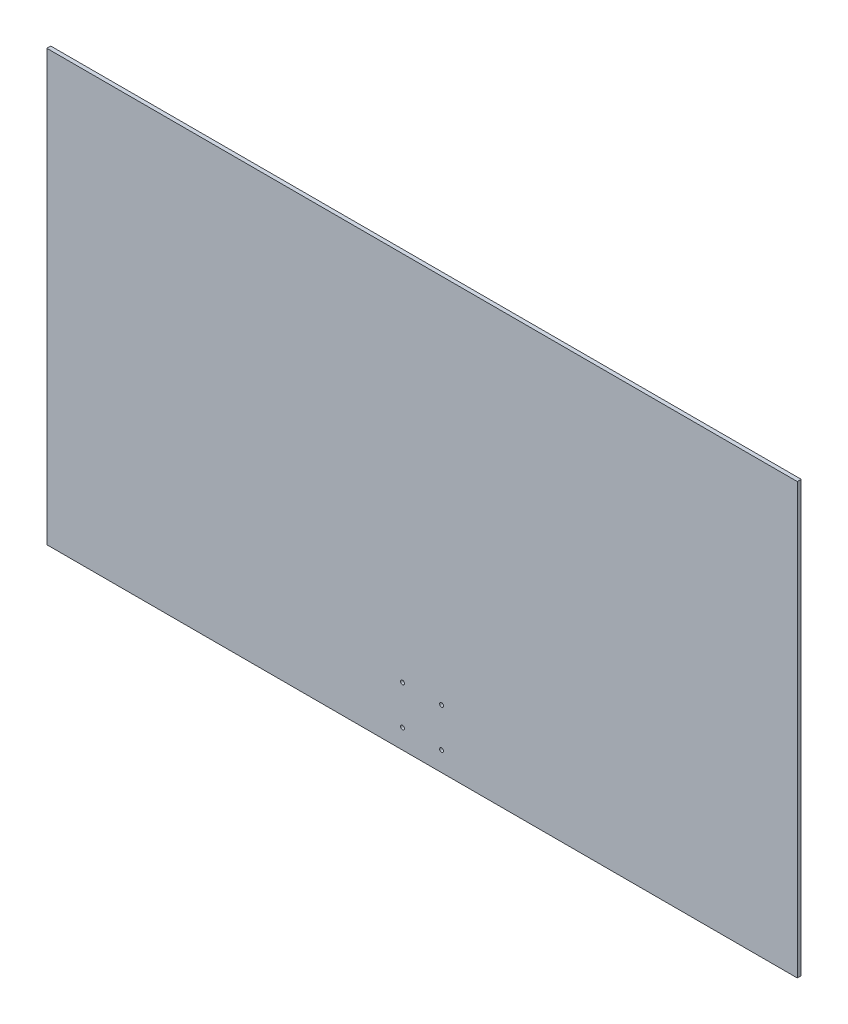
ISO-10303-21;
HEADER;
FILE_DESCRIPTION(('STEP AP214'),'2;1');
FILE_NAME('part.step','',(''),(''),'','','');
FILE_SCHEMA(('AUTOMOTIVE_DESIGN { 1 0 10303 214 1 1 1 1 }'));
ENDSEC;
DATA;
#1=APPLICATION_CONTEXT('core data for automotive mechanical design processes');
#2=APPLICATION_PROTOCOL_DEFINITION('international standard','automotive_design',2000,#1);
#3=PRODUCT_CONTEXT('',#1,'mechanical');
#4=PRODUCT('Part','Part','',(#3));
#5=PRODUCT_RELATED_PRODUCT_CATEGORY('part','',(#4));
#6=PRODUCT_DEFINITION_FORMATION('','',#4);
#7=PRODUCT_DEFINITION_CONTEXT('part definition',#1,'design');
#8=PRODUCT_DEFINITION('design','',#6,#7);
#9=PRODUCT_DEFINITION_SHAPE('','',#8);
#10=(LENGTH_UNIT() NAMED_UNIT(*) SI_UNIT(.MILLI.,.METRE.));
#11=(NAMED_UNIT(*) PLANE_ANGLE_UNIT() SI_UNIT($,.RADIAN.));
#12=(NAMED_UNIT(*) SI_UNIT($,.STERADIAN.) SOLID_ANGLE_UNIT());
#13=UNCERTAINTY_MEASURE_WITH_UNIT(LENGTH_MEASURE(1.E-05),#10,'distance_accuracy_value','');
#14=(GEOMETRIC_REPRESENTATION_CONTEXT(3) GLOBAL_UNCERTAINTY_ASSIGNED_CONTEXT((#13)) GLOBAL_UNIT_ASSIGNED_CONTEXT((#10,
#11,#12)) REPRESENTATION_CONTEXT('',''));
#15=CARTESIAN_POINT('',(0.,0.,0.));
#16=DIRECTION('',(0.,0.,1.));
#17=DIRECTION('',(1.,0.,0.));
#18=AXIS2_PLACEMENT_3D('',#15,#16,#17);
#19=CARTESIAN_POINT('',(0.,0.,5.));
#20=DIRECTION('',(0.,0.,-1.));
#21=DIRECTION('',(-1.,0.,0.));
#22=AXIS2_PLACEMENT_3D('',#19,#20,#21);
#23=PLANE('',#22);
#24=DIRECTION('',(0.,-1.,0.));
#25=VECTOR('',#24,1.);
#26=CARTESIAN_POINT('',(0.,0.,5.));
#27=LINE('',#26,#25);
#28=CARTESIAN_POINT('',(0.,550.,5.));
#29=VERTEX_POINT('',#28);
#30=CARTESIAN_POINT('',(0.,0.,5.));
#31=VERTEX_POINT('',#30);
#32=EDGE_CURVE('E85',#29,#31,#27,.T.);
#33=ORIENTED_EDGE('',*,*,#32,.T.);
#34=DIRECTION('',(1.,0.,0.));
#35=VECTOR('',#34,1.);
#36=CARTESIAN_POINT('',(0.,0.,5.));
#37=LINE('',#36,#35);
#38=CARTESIAN_POINT('',(960.,1.17566092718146E-13,5.));
#39=VERTEX_POINT('',#38);
#40=EDGE_CURVE('E80',#31,#39,#37,.T.);
#41=ORIENTED_EDGE('',*,*,#40,.T.);
#42=DIRECTION('',(0.,1.,0.));
#43=VECTOR('',#42,1.);
#44=CARTESIAN_POINT('',(960.,1.17566092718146E-13,5.));
#45=LINE('',#44,#43);
#46=CARTESIAN_POINT('',(960.,550.,5.));
#47=VERTEX_POINT('',#46);
#48=EDGE_CURVE('E83',#39,#47,#45,.T.);
#49=ORIENTED_EDGE('',*,*,#48,.T.);
#50=DIRECTION('',(-1.,0.,0.));
#51=VECTOR('',#50,1.);
#52=CARTESIAN_POINT('',(0.,550.,5.));
#53=LINE('',#52,#51);
#54=EDGE_CURVE('E50',#47,#29,#53,.T.);
#55=ORIENTED_EDGE('',*,*,#54,.T.);
#56=EDGE_LOOP('',(#33,#41,#49,#55));
#57=FACE_BOUND('',#56,.T.);
#58=CARTESIAN_POINT('',(455.,25.,5.));
#59=DIRECTION('',(0.,0.,1.));
#60=DIRECTION('',(1.,0.,0.));
#61=AXIS2_PLACEMENT_3D('',#58,#59,#60);
#62=CIRCLE('',#61,2.50000000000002);
#63=CARTESIAN_POINT('',(457.5,25.,5.));
#64=VERTEX_POINT('',#63);
#65=EDGE_CURVE('E100',#64,#64,#62,.T.);
#66=ORIENTED_EDGE('',*,*,#65,.F.);
#67=EDGE_LOOP('',(#66));
#68=FACE_BOUND('',#67,.T.);
#69=CARTESIAN_POINT('',(455.,75.,5.));
#70=DIRECTION('',(0.,0.,1.));
#71=DIRECTION('',(1.,0.,0.));
#72=AXIS2_PLACEMENT_3D('',#69,#70,#71);
#73=CIRCLE('',#72,2.50000000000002);
#74=CARTESIAN_POINT('',(457.5,75.,5.));
#75=VERTEX_POINT('',#74);
#76=EDGE_CURVE('E115',#75,#75,#73,.T.);
#77=ORIENTED_EDGE('',*,*,#76,.F.);
#78=EDGE_LOOP('',(#77));
#79=FACE_BOUND('',#78,.T.);
#80=CARTESIAN_POINT('',(505.,25.,5.));
#81=DIRECTION('',(0.,0.,1.));
#82=DIRECTION('',(-1.,0.,0.));
#83=AXIS2_PLACEMENT_3D('',#80,#81,#82);
#84=CIRCLE('',#83,2.50000000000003);
#85=CARTESIAN_POINT('',(502.5,25.,5.));
#86=VERTEX_POINT('',#85);
#87=EDGE_CURVE('E121',#86,#86,#84,.T.);
#88=ORIENTED_EDGE('',*,*,#87,.F.);
#89=EDGE_LOOP('',(#88));
#90=FACE_BOUND('',#89,.T.);
#91=CARTESIAN_POINT('',(505.,75.,5.));
#92=DIRECTION('',(0.,0.,1.));
#93=DIRECTION('',(-1.,0.,0.));
#94=AXIS2_PLACEMENT_3D('',#91,#92,#93);
#95=CIRCLE('',#94,2.50000000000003);
#96=CARTESIAN_POINT('',(502.5,75.,5.));
#97=VERTEX_POINT('',#96);
#98=EDGE_CURVE('E127',#97,#97,#95,.T.);
#99=ORIENTED_EDGE('',*,*,#98,.F.);
#100=EDGE_LOOP('',(#99));
#101=FACE_BOUND('',#100,.T.);
#102=ADVANCED_FACE('F33',(#57,#68,#79,#90,#101),#23,.F.);
#103=CARTESIAN_POINT('',(0.,0.,0.));
#104=DIRECTION('',(0.,0.,-1.));
#105=DIRECTION('',(-1.,0.,0.));
#106=AXIS2_PLACEMENT_3D('',#103,#104,#105);
#107=PLANE('',#106);
#108=CARTESIAN_POINT('',(505.,25.,0.));
#109=DIRECTION('',(0.,0.,1.));
#110=DIRECTION('',(-1.,0.,0.));
#111=AXIS2_PLACEMENT_3D('',#108,#109,#110);
#112=CIRCLE('',#111,2.50000000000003);
#113=CARTESIAN_POINT('',(502.5,25.,0.));
#114=VERTEX_POINT('',#113);
#115=EDGE_CURVE('E124',#114,#114,#112,.T.);
#116=ORIENTED_EDGE('',*,*,#115,.T.);
#117=EDGE_LOOP('',(#116));
#118=FACE_BOUND('',#117,.T.);
#119=CARTESIAN_POINT('',(455.,25.,0.));
#120=DIRECTION('',(0.,0.,1.));
#121=DIRECTION('',(1.,0.,0.));
#122=AXIS2_PLACEMENT_3D('',#119,#120,#121);
#123=CIRCLE('',#122,2.50000000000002);
#124=CARTESIAN_POINT('',(457.5,25.,0.));
#125=VERTEX_POINT('',#124);
#126=EDGE_CURVE('E112',#125,#125,#123,.T.);
#127=ORIENTED_EDGE('',*,*,#126,.T.);
#128=EDGE_LOOP('',(#127));
#129=FACE_BOUND('',#128,.T.);
#130=DIRECTION('',(0.,-1.,0.));
#131=VECTOR('',#130,1.);
#132=CARTESIAN_POINT('',(0.,0.,0.));
#133=LINE('',#132,#131);
#134=CARTESIAN_POINT('',(0.,550.,0.));
#135=VERTEX_POINT('',#134);
#136=CARTESIAN_POINT('',(0.,0.,0.));
#137=VERTEX_POINT('',#136);
#138=EDGE_CURVE('E97',#135,#137,#133,.T.);
#139=ORIENTED_EDGE('',*,*,#138,.F.);
#140=DIRECTION('',(-1.,0.,0.));
#141=VECTOR('',#140,1.);
#142=CARTESIAN_POINT('',(0.,550.,0.));
#143=LINE('',#142,#141);
#144=CARTESIAN_POINT('',(960.,550.,0.));
#145=VERTEX_POINT('',#144);
#146=EDGE_CURVE('E73',#145,#135,#143,.T.);
#147=ORIENTED_EDGE('',*,*,#146,.F.);
#148=DIRECTION('',(0.,1.,0.));
#149=VECTOR('',#148,1.);
#150=CARTESIAN_POINT('',(960.,1.17566092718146E-13,0.));
#151=LINE('',#150,#149);
#152=CARTESIAN_POINT('',(960.,1.17566092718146E-13,0.));
#153=VERTEX_POINT('',#152);
#154=EDGE_CURVE('E67',#153,#145,#151,.T.);
#155=ORIENTED_EDGE('',*,*,#154,.F.);
#156=DIRECTION('',(1.,0.,0.));
#157=VECTOR('',#156,1.);
#158=CARTESIAN_POINT('',(0.,0.,0.));
#159=LINE('',#158,#157);
#160=EDGE_CURVE('E89',#137,#153,#159,.T.);
#161=ORIENTED_EDGE('',*,*,#160,.F.);
#162=EDGE_LOOP('',(#139,#147,#155,#161));
#163=FACE_BOUND('',#162,.T.);
#164=CARTESIAN_POINT('',(455.,75.,0.));
#165=DIRECTION('',(0.,0.,1.));
#166=DIRECTION('',(1.,0.,0.));
#167=AXIS2_PLACEMENT_3D('',#164,#165,#166);
#168=CIRCLE('',#167,2.50000000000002);
#169=CARTESIAN_POINT('',(457.5,75.,0.));
#170=VERTEX_POINT('',#169);
#171=EDGE_CURVE('E118',#170,#170,#168,.T.);
#172=ORIENTED_EDGE('',*,*,#171,.T.);
#173=EDGE_LOOP('',(#172));
#174=FACE_BOUND('',#173,.T.);
#175=CARTESIAN_POINT('',(505.,75.,0.));
#176=DIRECTION('',(0.,0.,1.));
#177=DIRECTION('',(-1.,0.,0.));
#178=AXIS2_PLACEMENT_3D('',#175,#176,#177);
#179=CIRCLE('',#178,2.50000000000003);
#180=CARTESIAN_POINT('',(502.5,75.,0.));
#181=VERTEX_POINT('',#180);
#182=EDGE_CURVE('E130',#181,#181,#179,.T.);
#183=ORIENTED_EDGE('',*,*,#182,.T.);
#184=EDGE_LOOP('',(#183));
#185=FACE_BOUND('',#184,.T.);
#186=ADVANCED_FACE('F108',(#118,#129,#163,#174,#185),#107,.T.);
#187=CARTESIAN_POINT('',(0.,0.,5.));
#188=DIRECTION('',(1.,0.,0.));
#189=DIRECTION('',(0.,0.,-1.));
#190=AXIS2_PLACEMENT_3D('',#187,#188,#189);
#191=PLANE('',#190);
#192=ORIENTED_EDGE('',*,*,#138,.T.);
#193=DIRECTION('',(0.,0.,-1.));
#194=VECTOR('',#193,1.);
#195=CARTESIAN_POINT('',(0.,0.,5.));
#196=LINE('',#195,#194);
#197=EDGE_CURVE('E11',#31,#137,#196,.T.);
#198=ORIENTED_EDGE('',*,*,#197,.F.);
#199=ORIENTED_EDGE('',*,*,#32,.F.);
#200=DIRECTION('',(0.,0.,-1.));
#201=VECTOR('',#200,1.);
#202=CARTESIAN_POINT('',(0.,550.,5.));
#203=LINE('',#202,#201);
#204=EDGE_CURVE('E93',#29,#135,#203,.T.);
#205=ORIENTED_EDGE('',*,*,#204,.T.);
#206=EDGE_LOOP('',(#192,#198,#199,#205));
#207=FACE_BOUND('',#206,.T.);
#208=ADVANCED_FACE('F35',(#207),#191,.F.);
#209=CARTESIAN_POINT('',(0.,0.,5.));
#210=DIRECTION('',(0.,1.,0.));
#211=DIRECTION('',(-1.,0.,0.));
#212=AXIS2_PLACEMENT_3D('',#209,#210,#211);
#213=PLANE('',#212);
#214=ORIENTED_EDGE('',*,*,#160,.T.);
#215=DIRECTION('',(0.,0.,-1.));
#216=VECTOR('',#215,1.);
#217=CARTESIAN_POINT('',(960.,1.17566092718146E-13,5.));
#218=LINE('',#217,#216);
#219=EDGE_CURVE('E42',#39,#153,#218,.T.);
#220=ORIENTED_EDGE('',*,*,#219,.F.);
#221=ORIENTED_EDGE('',*,*,#40,.F.);
#222=ORIENTED_EDGE('',*,*,#197,.T.);
#223=EDGE_LOOP('',(#214,#220,#221,#222));
#224=FACE_BOUND('',#223,.T.);
#225=ADVANCED_FACE('F88',(#224),#213,.F.);
#226=CARTESIAN_POINT('',(960.,1.17566092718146E-13,5.));
#227=DIRECTION('',(-1.,0.,0.));
#228=DIRECTION('',(0.,-1.,0.));
#229=AXIS2_PLACEMENT_3D('',#226,#227,#228);
#230=PLANE('',#229);
#231=ORIENTED_EDGE('',*,*,#154,.T.);
#232=DIRECTION('',(0.,0.,-1.));
#233=VECTOR('',#232,1.);
#234=CARTESIAN_POINT('',(960.,550.,5.));
#235=LINE('',#234,#233);
#236=EDGE_CURVE('E90',#47,#145,#235,.T.);
#237=ORIENTED_EDGE('',*,*,#236,.F.);
#238=ORIENTED_EDGE('',*,*,#48,.F.);
#239=ORIENTED_EDGE('',*,*,#219,.T.);
#240=EDGE_LOOP('',(#231,#237,#238,#239));
#241=FACE_BOUND('',#240,.T.);
#242=ADVANCED_FACE('F91',(#241),#230,.F.);
#243=CARTESIAN_POINT('',(0.,550.,5.));
#244=DIRECTION('',(0.,-1.,0.));
#245=DIRECTION('',(1.,0.,0.));
#246=AXIS2_PLACEMENT_3D('',#243,#244,#245);
#247=PLANE('',#246);
#248=ORIENTED_EDGE('',*,*,#146,.T.);
#249=ORIENTED_EDGE('',*,*,#204,.F.);
#250=ORIENTED_EDGE('',*,*,#54,.F.);
#251=ORIENTED_EDGE('',*,*,#236,.T.);
#252=EDGE_LOOP('',(#248,#249,#250,#251));
#253=FACE_BOUND('',#252,.T.);
#254=ADVANCED_FACE('F105',(#253),#247,.F.);
#255=CARTESIAN_POINT('',(455.,25.,5.));
#256=DIRECTION('',(0.,0.,-1.));
#257=DIRECTION('',(-1.,0.,0.));
#258=AXIS2_PLACEMENT_3D('',#255,#256,#257);
#259=CYLINDRICAL_SURFACE('',#258,2.50000000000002);
#260=ORIENTED_EDGE('',*,*,#65,.T.);
#261=EDGE_LOOP('',(#260));
#262=FACE_BOUND('',#261,.T.);
#263=ORIENTED_EDGE('',*,*,#126,.F.);
#264=EDGE_LOOP('',(#263));
#265=FACE_BOUND('',#264,.T.);
#266=ADVANCED_FACE('F147',(#262,#265),#259,.F.);
#267=CARTESIAN_POINT('',(455.,75.,5.));
#268=DIRECTION('',(0.,0.,-1.));
#269=DIRECTION('',(-1.,0.,0.));
#270=AXIS2_PLACEMENT_3D('',#267,#268,#269);
#271=CYLINDRICAL_SURFACE('',#270,2.50000000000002);
#272=ORIENTED_EDGE('',*,*,#76,.T.);
#273=EDGE_LOOP('',(#272));
#274=FACE_BOUND('',#273,.T.);
#275=ORIENTED_EDGE('',*,*,#171,.F.);
#276=EDGE_LOOP('',(#275));
#277=FACE_BOUND('',#276,.T.);
#278=ADVANCED_FACE('F193',(#274,#277),#271,.F.);
#279=CARTESIAN_POINT('',(505.,25.,5.));
#280=DIRECTION('',(0.,0.,-1.));
#281=DIRECTION('',(-1.,0.,0.));
#282=AXIS2_PLACEMENT_3D('',#279,#280,#281);
#283=CYLINDRICAL_SURFACE('',#282,2.50000000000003);
#284=ORIENTED_EDGE('',*,*,#87,.T.);
#285=EDGE_LOOP('',(#284));
#286=FACE_BOUND('',#285,.T.);
#287=ORIENTED_EDGE('',*,*,#115,.F.);
#288=EDGE_LOOP('',(#287));
#289=FACE_BOUND('',#288,.T.);
#290=ADVANCED_FACE('F201',(#286,#289),#283,.F.);
#291=CARTESIAN_POINT('',(505.,75.,5.));
#292=DIRECTION('',(0.,0.,-1.));
#293=DIRECTION('',(-1.,0.,0.));
#294=AXIS2_PLACEMENT_3D('',#291,#292,#293);
#295=CYLINDRICAL_SURFACE('',#294,2.50000000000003);
#296=ORIENTED_EDGE('',*,*,#98,.T.);
#297=EDGE_LOOP('',(#296));
#298=FACE_BOUND('',#297,.T.);
#299=ORIENTED_EDGE('',*,*,#182,.F.);
#300=EDGE_LOOP('',(#299));
#301=FACE_BOUND('',#300,.T.);
#302=ADVANCED_FACE('F136',(#298,#301),#295,.F.);
#303=CLOSED_SHELL('',(#102,#186,#208,#225,#242,#254,#266,#278,#290,#302));
#304=MANIFOLD_SOLID_BREP('B2',#303);
#305=ADVANCED_BREP_SHAPE_REPRESENTATION('',(#18,#304),#14);
#306=SHAPE_DEFINITION_REPRESENTATION(#9,#305);
ENDSEC;
END-ISO-10303-21;
